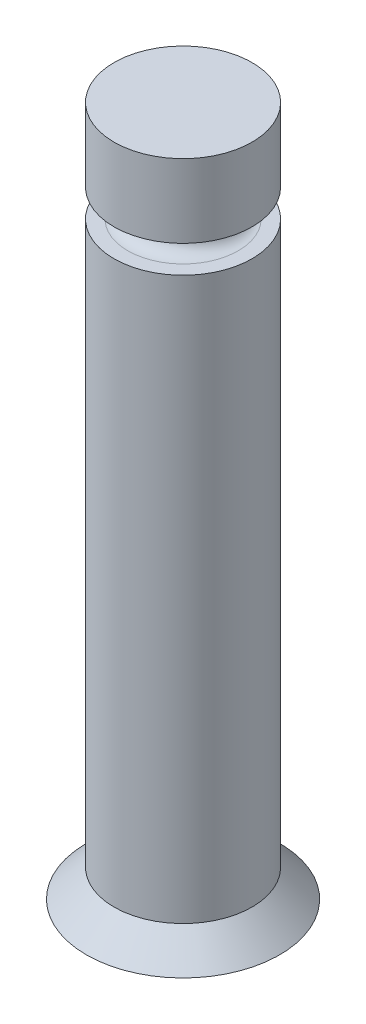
ISO-10303-21;
HEADER;
FILE_DESCRIPTION(('STEP AP214'),'2;1');
FILE_NAME('part.step','',(''),(''),'','','');
FILE_SCHEMA(('AUTOMOTIVE_DESIGN { 1 0 10303 214 1 1 1 1 }'));
ENDSEC;
DATA;
#1=APPLICATION_CONTEXT('core data for automotive mechanical design processes');
#2=APPLICATION_PROTOCOL_DEFINITION('international standard','automotive_design',2000,#1);
#3=PRODUCT_CONTEXT('',#1,'mechanical');
#4=PRODUCT('Part','Part','',(#3));
#5=PRODUCT_RELATED_PRODUCT_CATEGORY('part','',(#4));
#6=PRODUCT_DEFINITION_FORMATION('','',#4);
#7=PRODUCT_DEFINITION_CONTEXT('part definition',#1,'design');
#8=PRODUCT_DEFINITION('design','',#6,#7);
#9=PRODUCT_DEFINITION_SHAPE('','',#8);
#10=(LENGTH_UNIT() NAMED_UNIT(*) SI_UNIT(.MILLI.,.METRE.));
#11=(NAMED_UNIT(*) PLANE_ANGLE_UNIT() SI_UNIT($,.RADIAN.));
#12=(NAMED_UNIT(*) SI_UNIT($,.STERADIAN.) SOLID_ANGLE_UNIT());
#13=UNCERTAINTY_MEASURE_WITH_UNIT(LENGTH_MEASURE(1.E-05),#10,'distance_accuracy_value','');
#14=(GEOMETRIC_REPRESENTATION_CONTEXT(3) GLOBAL_UNCERTAINTY_ASSIGNED_CONTEXT((#13)) GLOBAL_UNIT_ASSIGNED_CONTEXT((#10,
#11,#12)) REPRESENTATION_CONTEXT('',''));
#15=CARTESIAN_POINT('',(0.,0.,0.));
#16=DIRECTION('',(0.,0.,1.));
#17=DIRECTION('',(1.,0.,0.));
#18=AXIS2_PLACEMENT_3D('',#15,#16,#17);
#19=CARTESIAN_POINT('',(-6.99999999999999,-50.,0.));
#20=DIRECTION('',(0.,-1.,0.));
#21=DIRECTION('',(0.,0.,-1.));
#22=AXIS2_PLACEMENT_3D('',#19,#20,#21);
#23=PLANE('',#22);
#24=CARTESIAN_POINT('',(0.,-50.,0.));
#25=DIRECTION('',(0.,1.,0.));
#26=DIRECTION('',(0.,0.,1.));
#27=AXIS2_PLACEMENT_3D('',#24,#25,#26);
#28=CIRCLE('',#27,6.99999999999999);
#29=CARTESIAN_POINT('',(0.,-50.,6.99999999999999));
#30=VERTEX_POINT('',#29);
#31=EDGE_CURVE('E10',#30,#30,#28,.T.);
#32=ORIENTED_EDGE('',*,*,#31,.F.);
#33=EDGE_LOOP('',(#32));
#34=FACE_BOUND('',#33,.T.);
#35=ADVANCED_FACE('F33',(#34),#23,.T.);
#36=CARTESIAN_POINT('',(0.,-47.9999999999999,0.));
#37=DIRECTION('',(0.,-1.,0.));
#38=DIRECTION('',(0.,0.,-1.));
#39=AXIS2_PLACEMENT_3D('',#36,#37,#38);
#40=CONICAL_SURFACE('',#39,4.99999999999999,0.785398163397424);
#41=ORIENTED_EDGE('',*,*,#31,.T.);
#42=EDGE_LOOP('',(#41));
#43=FACE_BOUND('',#42,.T.);
#44=CARTESIAN_POINT('',(0.,-47.9999999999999,0.));
#45=DIRECTION('',(0.,1.,0.));
#46=DIRECTION('',(0.,0.,1.));
#47=AXIS2_PLACEMENT_3D('',#44,#45,#46);
#48=CIRCLE('',#47,4.99999999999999);
#49=CARTESIAN_POINT('',(0.,-47.9999999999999,4.99999999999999));
#50=VERTEX_POINT('',#49);
#51=EDGE_CURVE('E39',#50,#50,#48,.T.);
#52=ORIENTED_EDGE('',*,*,#51,.F.);
#53=EDGE_LOOP('',(#52));
#54=FACE_BOUND('',#53,.T.);
#55=ADVANCED_FACE('F78',(#43,#54),#40,.T.);
#56=CARTESIAN_POINT('',(0.,0.,0.));
#57=DIRECTION('',(0.,1.,0.));
#58=DIRECTION('',(0.,0.,1.));
#59=AXIS2_PLACEMENT_3D('',#56,#57,#58);
#60=CYLINDRICAL_SURFACE('',#59,5.);
#61=ORIENTED_EDGE('',*,*,#51,.T.);
#62=EDGE_LOOP('',(#61));
#63=FACE_BOUND('',#62,.T.);
#64=CARTESIAN_POINT('',(0.,-7.31631907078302,0.));
#65=DIRECTION('',(0.,1.,0.));
#66=DIRECTION('',(0.,0.,1.));
#67=AXIS2_PLACEMENT_3D('',#64,#65,#66);
#68=CIRCLE('',#67,5.);
#69=CARTESIAN_POINT('',(0.,-7.31631907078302,5.));
#70=VERTEX_POINT('',#69);
#71=EDGE_CURVE('E43',#70,#70,#68,.T.);
#72=ORIENTED_EDGE('',*,*,#71,.F.);
#73=EDGE_LOOP('',(#72));
#74=FACE_BOUND('',#73,.T.);
#75=ADVANCED_FACE('F83',(#63,#74),#60,.T.);
#76=CARTESIAN_POINT('',(-4.,-7.31631907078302,0.));
#77=DIRECTION('',(0.,1.,0.));
#78=DIRECTION('',(0.,0.,1.));
#79=AXIS2_PLACEMENT_3D('',#76,#77,#78);
#80=PLANE('',#79);
#81=ORIENTED_EDGE('',*,*,#71,.T.);
#82=EDGE_LOOP('',(#81));
#83=FACE_BOUND('',#82,.T.);
#84=CARTESIAN_POINT('',(0.,-7.31631907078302,0.));
#85=DIRECTION('',(0.,1.,0.));
#86=DIRECTION('',(0.,0.,1.));
#87=AXIS2_PLACEMENT_3D('',#84,#85,#86);
#88=CIRCLE('',#87,4.);
#89=CARTESIAN_POINT('',(0.,-7.31631907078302,4.));
#90=VERTEX_POINT('',#89);
#91=EDGE_CURVE('E47',#90,#90,#88,.T.);
#92=ORIENTED_EDGE('',*,*,#91,.F.);
#93=EDGE_LOOP('',(#92));
#94=FACE_BOUND('',#93,.T.);
#95=ADVANCED_FACE('F87',(#83,#94),#80,.T.);
#96=CARTESIAN_POINT('',(0.,-6.31631907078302,0.));
#97=DIRECTION('',(0.,1.,0.));
#98=DIRECTION('',(0.,0.,1.));
#99=AXIS2_PLACEMENT_3D('',#96,#97,#98);
#100=TOROIDAL_SURFACE('',#99,4.,1.);
#101=ORIENTED_EDGE('',*,*,#91,.T.);
#102=EDGE_LOOP('',(#101));
#103=FACE_BOUND('',#102,.T.);
#104=CARTESIAN_POINT('',(0.,-5.31631907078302,0.));
#105=DIRECTION('',(0.,1.,0.));
#106=DIRECTION('',(0.,0.,1.));
#107=AXIS2_PLACEMENT_3D('',#104,#105,#106);
#108=CIRCLE('',#107,4.);
#109=CARTESIAN_POINT('',(0.,-5.31631907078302,4.));
#110=VERTEX_POINT('',#109);
#111=EDGE_CURVE('E52',#110,#110,#108,.T.);
#112=ORIENTED_EDGE('',*,*,#111,.F.);
#113=EDGE_LOOP('',(#112));
#114=FACE_BOUND('',#113,.T.);
#115=ADVANCED_FACE('F74',(#103,#114),#100,.F.);
#116=CARTESIAN_POINT('',(-5.,-5.31631907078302,0.));
#117=DIRECTION('',(0.,-1.,0.));
#118=DIRECTION('',(0.,0.,-1.));
#119=AXIS2_PLACEMENT_3D('',#116,#117,#118);
#120=PLANE('',#119);
#121=ORIENTED_EDGE('',*,*,#111,.T.);
#122=EDGE_LOOP('',(#121));
#123=FACE_BOUND('',#122,.T.);
#124=CARTESIAN_POINT('',(0.,-5.31631907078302,0.));
#125=DIRECTION('',(0.,1.,0.));
#126=DIRECTION('',(0.,0.,1.));
#127=AXIS2_PLACEMENT_3D('',#124,#125,#126);
#128=CIRCLE('',#127,5.);
#129=CARTESIAN_POINT('',(0.,-5.31631907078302,5.));
#130=VERTEX_POINT('',#129);
#131=EDGE_CURVE('E55',#130,#130,#128,.T.);
#132=ORIENTED_EDGE('',*,*,#131,.F.);
#133=EDGE_LOOP('',(#132));
#134=FACE_BOUND('',#133,.T.);
#135=ADVANCED_FACE('F66',(#123,#134),#120,.T.);
#136=CARTESIAN_POINT('',(0.,0.,0.));
#137=DIRECTION('',(0.,1.,0.));
#138=DIRECTION('',(0.,0.,1.));
#139=AXIS2_PLACEMENT_3D('',#136,#137,#138);
#140=CYLINDRICAL_SURFACE('',#139,5.);
#141=ORIENTED_EDGE('',*,*,#131,.T.);
#142=EDGE_LOOP('',(#141));
#143=FACE_BOUND('',#142,.T.);
#144=CARTESIAN_POINT('',(0.,0.,0.));
#145=DIRECTION('',(0.,1.,0.));
#146=DIRECTION('',(0.,0.,1.));
#147=AXIS2_PLACEMENT_3D('',#144,#145,#146);
#148=CIRCLE('',#147,5.);
#149=CARTESIAN_POINT('',(0.,0.,5.));
#150=VERTEX_POINT('',#149);
#151=EDGE_CURVE('E58',#150,#150,#148,.T.);
#152=ORIENTED_EDGE('',*,*,#151,.F.);
#153=EDGE_LOOP('',(#152));
#154=FACE_BOUND('',#153,.T.);
#155=ADVANCED_FACE('F64',(#143,#154),#140,.T.);
#156=CARTESIAN_POINT('',(0.,0.,0.));
#157=DIRECTION('',(0.,1.,0.));
#158=DIRECTION('',(0.,0.,1.));
#159=AXIS2_PLACEMENT_3D('',#156,#157,#158);
#160=PLANE('',#159);
#161=ORIENTED_EDGE('',*,*,#151,.T.);
#162=EDGE_LOOP('',(#161));
#163=FACE_BOUND('',#162,.T.);
#164=ADVANCED_FACE('F62',(#163),#160,.T.);
#165=CLOSED_SHELL('',(#35,#55,#75,#95,#115,#135,#155,#164));
#166=MANIFOLD_SOLID_BREP('B2',#165);
#167=ADVANCED_BREP_SHAPE_REPRESENTATION('',(#18,#166),#14);
#168=SHAPE_DEFINITION_REPRESENTATION(#9,#167);
ENDSEC;
END-ISO-10303-21;
